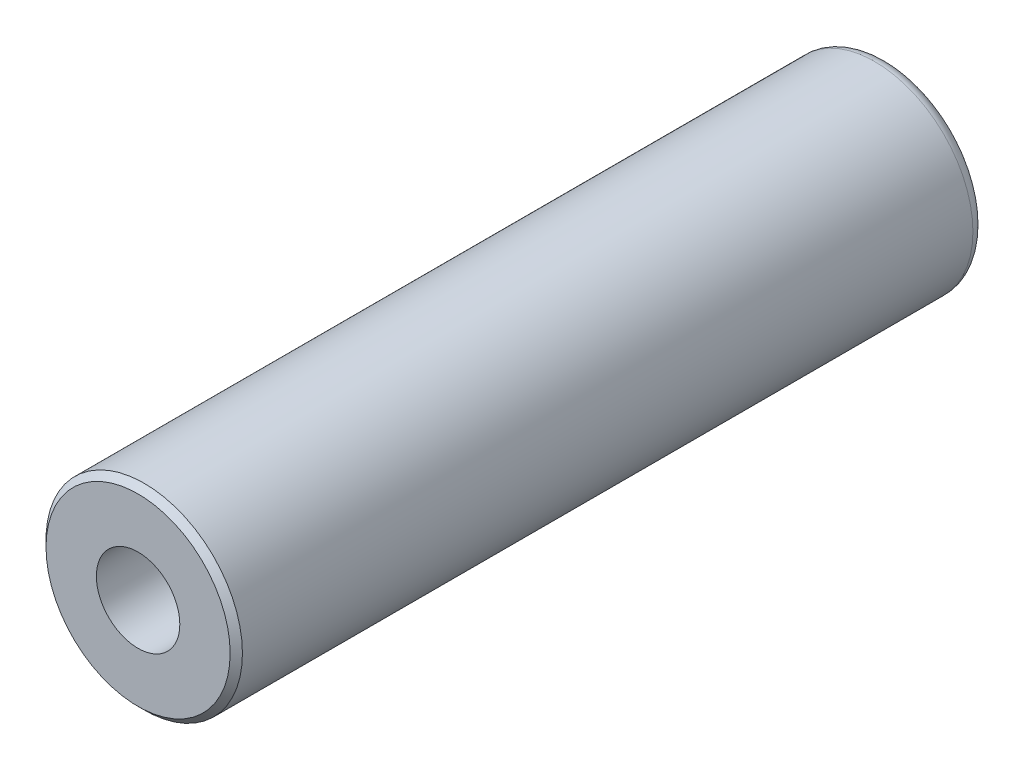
ISO-10303-21;
HEADER;
FILE_DESCRIPTION(('STEP AP214'),'2;1');
FILE_NAME('part.step','',(''),(''),'','','');
FILE_SCHEMA(('AUTOMOTIVE_DESIGN { 1 0 10303 214 1 1 1 1 }'));
ENDSEC;
DATA;
#1=APPLICATION_CONTEXT('core data for automotive mechanical design processes');
#2=APPLICATION_PROTOCOL_DEFINITION('international standard','automotive_design',2000,#1);
#3=PRODUCT_CONTEXT('',#1,'mechanical');
#4=PRODUCT('Part','Part','',(#3));
#5=PRODUCT_RELATED_PRODUCT_CATEGORY('part','',(#4));
#6=PRODUCT_DEFINITION_FORMATION('','',#4);
#7=PRODUCT_DEFINITION_CONTEXT('part definition',#1,'design');
#8=PRODUCT_DEFINITION('design','',#6,#7);
#9=PRODUCT_DEFINITION_SHAPE('','',#8);
#10=(LENGTH_UNIT() NAMED_UNIT(*) SI_UNIT(.MILLI.,.METRE.));
#11=(NAMED_UNIT(*) PLANE_ANGLE_UNIT() SI_UNIT($,.RADIAN.));
#12=(NAMED_UNIT(*) SI_UNIT($,.STERADIAN.) SOLID_ANGLE_UNIT());
#13=UNCERTAINTY_MEASURE_WITH_UNIT(LENGTH_MEASURE(1.E-05),#10,'distance_accuracy_value','');
#14=(GEOMETRIC_REPRESENTATION_CONTEXT(3) GLOBAL_UNCERTAINTY_ASSIGNED_CONTEXT((#13)) GLOBAL_UNIT_ASSIGNED_CONTEXT((#10,
#11,#12)) REPRESENTATION_CONTEXT('',''));
#15=CARTESIAN_POINT('',(0.,0.,0.));
#16=DIRECTION('',(0.,0.,1.));
#17=DIRECTION('',(1.,0.,0.));
#18=AXIS2_PLACEMENT_3D('',#15,#16,#17);
#19=CARTESIAN_POINT('',(0.,0.,61.));
#20=DIRECTION('',(0.,0.,-1.));
#21=DIRECTION('',(-1.,0.,0.));
#22=AXIS2_PLACEMENT_3D('',#19,#20,#21);
#23=CYLINDRICAL_SURFACE('',#22,8.);
#24=CARTESIAN_POINT('',(0.,0.,60.5));
#25=DIRECTION('',(0.,0.,1.));
#26=DIRECTION('',(1.,0.,0.));
#27=AXIS2_PLACEMENT_3D('',#24,#25,#26);
#28=CIRCLE('',#27,8.);
#29=CARTESIAN_POINT('',(8.,0.,60.5));
#30=VERTEX_POINT('',#29);
#31=EDGE_CURVE('E11',#30,#30,#28,.F.);
#32=ORIENTED_EDGE('',*,*,#31,.T.);
#33=EDGE_LOOP('',(#32));
#34=FACE_BOUND('',#33,.T.);
#35=CARTESIAN_POINT('',(0.,0.,1.));
#36=DIRECTION('',(0.,0.,1.));
#37=DIRECTION('',(1.,0.,0.));
#38=AXIS2_PLACEMENT_3D('',#35,#36,#37);
#39=CIRCLE('',#38,8.);
#40=CARTESIAN_POINT('',(8.,0.,1.));
#41=VERTEX_POINT('',#40);
#42=EDGE_CURVE('E54',#41,#41,#39,.T.);
#43=ORIENTED_EDGE('',*,*,#42,.T.);
#44=EDGE_LOOP('',(#43));
#45=FACE_BOUND('',#44,.T.);
#46=ADVANCED_FACE('F33',(#34,#45),#23,.T.);
#47=CARTESIAN_POINT('',(0.,0.,61.));
#48=DIRECTION('',(0.,0.,1.));
#49=DIRECTION('',(1.,0.,0.));
#50=AXIS2_PLACEMENT_3D('',#47,#48,#49);
#51=PLANE('',#50);
#52=CARTESIAN_POINT('',(0.,0.,61.));
#53=DIRECTION('',(0.,0.,1.));
#54=DIRECTION('',(1.,0.,0.));
#55=AXIS2_PLACEMENT_3D('',#52,#53,#54);
#56=CIRCLE('',#55,3.4);
#57=CARTESIAN_POINT('',(3.4,0.,61.));
#58=VERTEX_POINT('',#57);
#59=EDGE_CURVE('E51',#58,#58,#56,.T.);
#60=ORIENTED_EDGE('',*,*,#59,.F.);
#61=EDGE_LOOP('',(#60));
#62=FACE_BOUND('',#61,.T.);
#63=CARTESIAN_POINT('',(0.,0.,61.));
#64=DIRECTION('',(0.,0.,1.));
#65=DIRECTION('',(1.,0.,0.));
#66=AXIS2_PLACEMENT_3D('',#63,#64,#65);
#67=CIRCLE('',#66,7.49999999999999);
#68=CARTESIAN_POINT('',(7.49999999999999,0.,61.));
#69=VERTEX_POINT('',#68);
#70=EDGE_CURVE('E39',#69,#69,#67,.T.);
#71=ORIENTED_EDGE('',*,*,#70,.T.);
#72=EDGE_LOOP('',(#71));
#73=FACE_BOUND('',#72,.T.);
#74=ADVANCED_FACE('F64',(#62,#73),#51,.T.);
#75=CARTESIAN_POINT('',(0.,0.,0.));
#76=DIRECTION('',(0.,0.,1.));
#77=DIRECTION('',(1.,0.,0.));
#78=AXIS2_PLACEMENT_3D('',#75,#76,#77);
#79=PLANE('',#78);
#80=CARTESIAN_POINT('',(0.,0.,0.));
#81=DIRECTION('',(0.,0.,1.));
#82=DIRECTION('',(1.,0.,0.));
#83=AXIS2_PLACEMENT_3D('',#80,#81,#82);
#84=CIRCLE('',#83,7.);
#85=CARTESIAN_POINT('',(7.,0.,0.));
#86=VERTEX_POINT('',#85);
#87=EDGE_CURVE('E59',#86,#86,#84,.F.);
#88=ORIENTED_EDGE('',*,*,#87,.T.);
#89=EDGE_LOOP('',(#88));
#90=FACE_BOUND('',#89,.T.);
#91=ADVANCED_FACE('F76',(#90),#79,.F.);
#92=CARTESIAN_POINT('',(0.,0.,1.));
#93=DIRECTION('',(0.,0.,1.));
#94=DIRECTION('',(1.,0.,0.));
#95=AXIS2_PLACEMENT_3D('',#92,#93,#94);
#96=TOROIDAL_SURFACE('',#95,7.,1.);
#97=ORIENTED_EDGE('',*,*,#87,.F.);
#98=EDGE_LOOP('',(#97));
#99=FACE_BOUND('',#98,.T.);
#100=ORIENTED_EDGE('',*,*,#42,.F.);
#101=EDGE_LOOP('',(#100));
#102=FACE_BOUND('',#101,.T.);
#103=ADVANCED_FACE('F68',(#99,#102),#96,.T.);
#104=CARTESIAN_POINT('',(0.,0.,61.));
#105=DIRECTION('',(0.,0.,-1.));
#106=DIRECTION('',(-1.,0.,0.));
#107=AXIS2_PLACEMENT_3D('',#104,#105,#106);
#108=CONICAL_SURFACE('',#107,7.49999999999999,0.785398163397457);
#109=ORIENTED_EDGE('',*,*,#31,.F.);
#110=EDGE_LOOP('',(#109));
#111=FACE_BOUND('',#110,.T.);
#112=ORIENTED_EDGE('',*,*,#70,.F.);
#113=EDGE_LOOP('',(#112));
#114=FACE_BOUND('',#113,.T.);
#115=ADVANCED_FACE('F66',(#111,#114),#108,.T.);
#116=CARTESIAN_POINT('',(0.,0.,61.));
#117=DIRECTION('',(0.,0.,1.));
#118=DIRECTION('',(1.,0.,0.));
#119=AXIS2_PLACEMENT_3D('',#116,#117,#118);
#120=CYLINDRICAL_SURFACE('',#119,3.4);
#121=CARTESIAN_POINT('',(0.,0.,41.));
#122=DIRECTION('',(0.,0.,1.));
#123=DIRECTION('',(1.,0.,0.));
#124=AXIS2_PLACEMENT_3D('',#121,#122,#123);
#125=CIRCLE('',#124,3.4);
#126=CARTESIAN_POINT('',(3.4,0.,41.));
#127=VERTEX_POINT('',#126);
#128=EDGE_CURVE('E49',#127,#127,#125,.T.);
#129=ORIENTED_EDGE('',*,*,#128,.F.);
#130=EDGE_LOOP('',(#129));
#131=FACE_BOUND('',#130,.T.);
#132=ORIENTED_EDGE('',*,*,#59,.T.);
#133=EDGE_LOOP('',(#132));
#134=FACE_BOUND('',#133,.T.);
#135=ADVANCED_FACE('F45',(#131,#134),#120,.F.);
#136=CARTESIAN_POINT('',(0.,0.,41.));
#137=DIRECTION('',(0.,0.,1.));
#138=DIRECTION('',(1.,0.,0.));
#139=AXIS2_PLACEMENT_3D('',#136,#137,#138);
#140=CONICAL_SURFACE('',#139,3.4,1.02974425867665);
#141=CARTESIAN_POINT('',(0.,0.,38.9570738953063));
#142=VERTEX_POINT('',#141);
#143=VERTEX_LOOP('',#142);
#144=FACE_BOUND('',#143,.T.);
#145=ORIENTED_EDGE('',*,*,#128,.T.);
#146=EDGE_LOOP('',(#145));
#147=FACE_BOUND('',#146,.T.);
#148=ADVANCED_FACE('F42',(#144,#147),#140,.F.);
#149=CLOSED_SHELL('',(#46,#74,#91,#103,#115,#135,#148));
#150=MANIFOLD_SOLID_BREP('B2',#149);
#151=ADVANCED_BREP_SHAPE_REPRESENTATION('',(#18,#150),#14);
#152=SHAPE_DEFINITION_REPRESENTATION(#9,#151);
ENDSEC;
END-ISO-10303-21;
